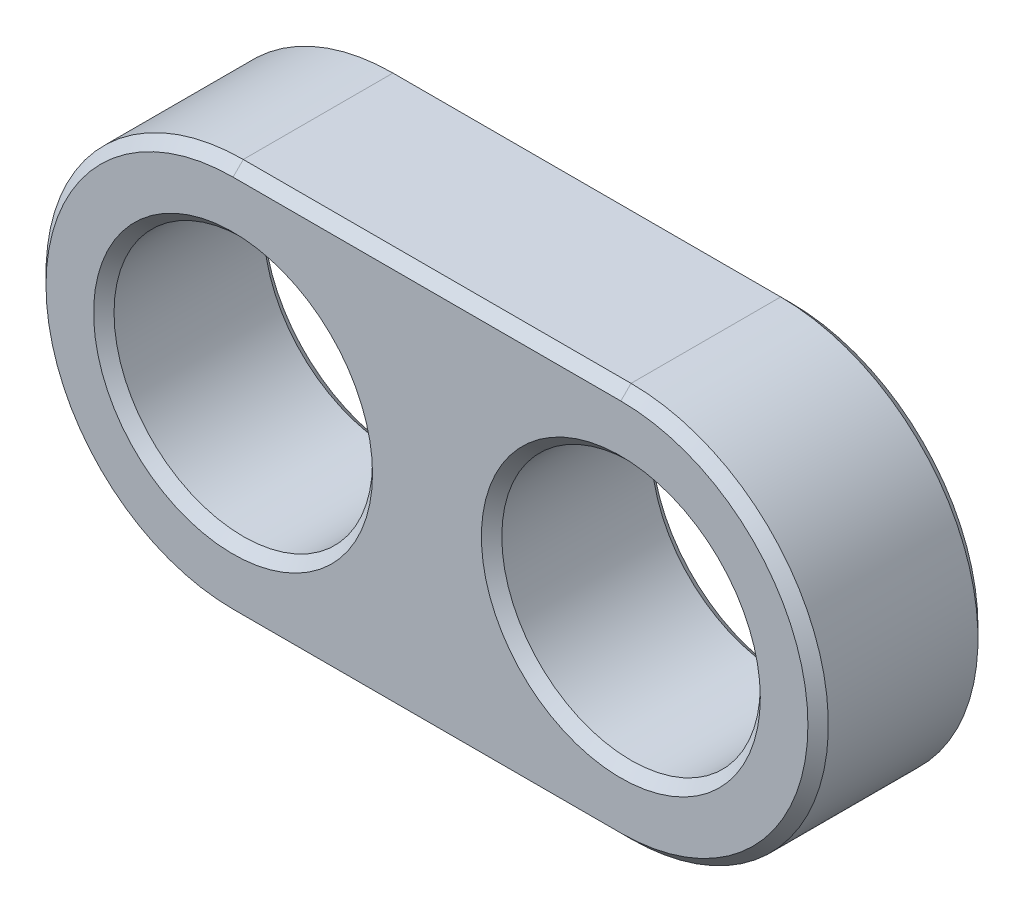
from build123d import *

# Parameters (mm, degrees)
ESQUISSE1_R      = 19
EXTRUSION1_DEPTH = 12.5
CHANFREIN1_SIZE  = 1.5


with BuildPart() as part:
    # Esquisse1 → Extrusion1 (new, symmetric)
    with BuildSketch(Plane.XY):
        with BuildLine():
            Line((0, 29), (57, 29))
            ThreePointArc((57, 29), (86, 0), (57, -29))
            Line((57, -29), (0, -29))
            ThreePointArc((0, -29), (-29, 0), (0, 29))
        make_face()
        Circle(ESQUISSE1_R, mode=Mode.SUBTRACT)
        with Locations((57, 0)):
            Circle(ESQUISSE1_R, mode=Mode.SUBTRACT)
    extrude(amount=EXTRUSION1_DEPTH, both=True)

    # Chanfrein1
    chanfrein1_edges = [part.edges().sort_by_distance(p)[0] for p in [
        (86, 0, 12.5),
        (-19, 0, -12.5),
        (-19, 0, 12.5),
        (28.5, 29, 12.5),
        (38, 0, -12.5),
        (38, 0, 12.5),
        (-29, 0, 12.5),
        (28.5, 29, -12.5),
        (86, 0, -12.5),
        (28.5, -29, -12.5),
        (-29, 0, -12.5),
        (28.5, -29, 12.5),
    ]]
    chamfer(chanfrein1_edges, length=CHANFREIN1_SIZE)


solid = part.part
